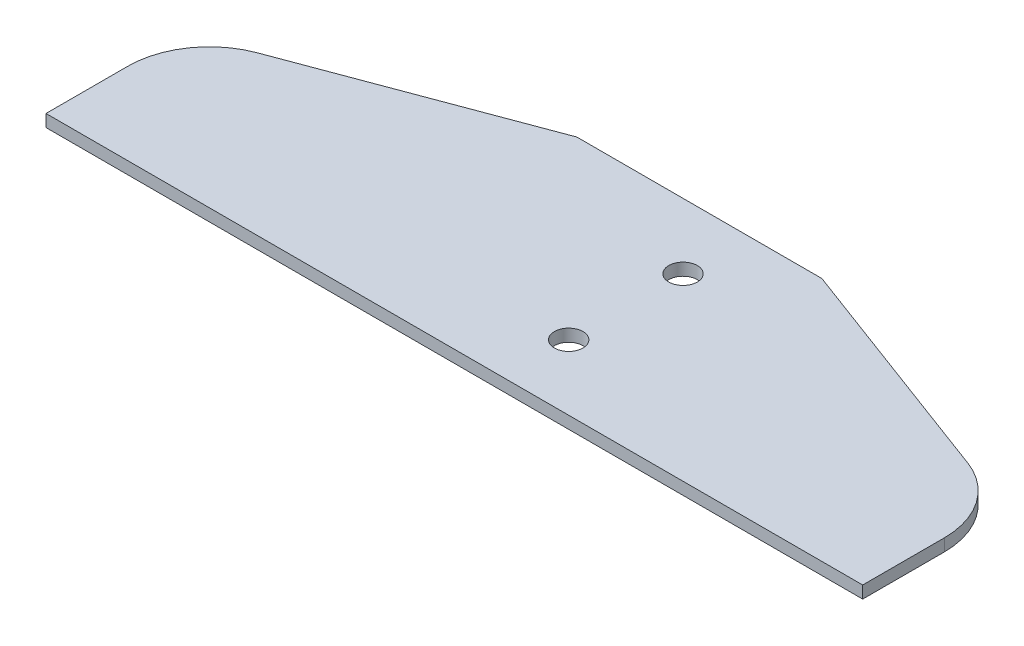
ISO-10303-21;
HEADER;
FILE_DESCRIPTION(('STEP AP214'),'2;1');
FILE_NAME('part.step','',(''),(''),'','','');
FILE_SCHEMA(('AUTOMOTIVE_DESIGN { 1 0 10303 214 1 1 1 1 }'));
ENDSEC;
DATA;
#1=APPLICATION_CONTEXT('core data for automotive mechanical design processes');
#2=APPLICATION_PROTOCOL_DEFINITION('international standard','automotive_design',2000,#1);
#3=PRODUCT_CONTEXT('',#1,'mechanical');
#4=PRODUCT('Part','Part','',(#3));
#5=PRODUCT_RELATED_PRODUCT_CATEGORY('part','',(#4));
#6=PRODUCT_DEFINITION_FORMATION('','',#4);
#7=PRODUCT_DEFINITION_CONTEXT('part definition',#1,'design');
#8=PRODUCT_DEFINITION('design','',#6,#7);
#9=PRODUCT_DEFINITION_SHAPE('','',#8);
#10=(LENGTH_UNIT() NAMED_UNIT(*) SI_UNIT(.MILLI.,.METRE.));
#11=(NAMED_UNIT(*) PLANE_ANGLE_UNIT() SI_UNIT($,.RADIAN.));
#12=(NAMED_UNIT(*) SI_UNIT($,.STERADIAN.) SOLID_ANGLE_UNIT());
#13=UNCERTAINTY_MEASURE_WITH_UNIT(LENGTH_MEASURE(1.E-05),#10,'distance_accuracy_value','');
#14=(GEOMETRIC_REPRESENTATION_CONTEXT(3) GLOBAL_UNCERTAINTY_ASSIGNED_CONTEXT((#13)) GLOBAL_UNIT_ASSIGNED_CONTEXT((#10,
#11,#12)) REPRESENTATION_CONTEXT('',''));
#15=CARTESIAN_POINT('',(0.,0.,0.));
#16=DIRECTION('',(0.,0.,1.));
#17=DIRECTION('',(1.,0.,0.));
#18=AXIS2_PLACEMENT_3D('',#15,#16,#17);
#19=CARTESIAN_POINT('',(39.9999999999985,1.5,-9.99999999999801));
#20=DIRECTION('',(0.,1.,0.));
#21=DIRECTION('',(0.,0.,1.));
#22=AXIS2_PLACEMENT_3D('',#19,#20,#21);
#23=PLANE('',#22);
#24=CARTESIAN_POINT('',(6.,1.5,-21.999999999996));
#25=DIRECTION('',(0.,1.,0.));
#26=DIRECTION('',(0.,0.,1.));
#27=AXIS2_PLACEMENT_3D('',#24,#25,#26);
#28=CIRCLE('',#27,1.75000000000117);
#29=CARTESIAN_POINT('',(6.,1.5,-20.2499999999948));
#30=VERTEX_POINT('',#29);
#31=EDGE_CURVE('E114',#30,#30,#28,.T.);
#32=ORIENTED_EDGE('',*,*,#31,.F.);
#33=EDGE_LOOP('',(#32));
#34=FACE_BOUND('',#33,.T.);
#35=DIRECTION('',(0.,0.,-1.));
#36=VECTOR('',#35,1.);
#37=CARTESIAN_POINT('',(49.9999999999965,1.5,0.));
#38=LINE('',#37,#36);
#39=CARTESIAN_POINT('',(49.9999999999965,1.5,0.));
#40=VERTEX_POINT('',#39);
#41=CARTESIAN_POINT('',(49.9999999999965,1.5,-9.99999999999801));
#42=VERTEX_POINT('',#41);
#43=EDGE_CURVE('E132',#40,#42,#38,.T.);
#44=ORIENTED_EDGE('',*,*,#43,.T.);
#45=CARTESIAN_POINT('',(39.9999999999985,1.5,-9.99999999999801));
#46=DIRECTION('',(0.,1.,0.));
#47=DIRECTION('',(0.,0.,1.));
#48=AXIS2_PLACEMENT_3D('',#45,#46,#47);
#49=CIRCLE('',#48,9.99999999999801);
#50=CARTESIAN_POINT('',(43.4953780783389,1.5,-19.3692225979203));
#51=VERTEX_POINT('',#50);
#52=EDGE_CURVE('E109',#42,#51,#49,.T.);
#53=ORIENTED_EDGE('',*,*,#52,.T.);
#54=DIRECTION('',(-0.936922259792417,0.,-0.349537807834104));
#55=VECTOR('',#54,1.);
#56=CARTESIAN_POINT('',(14.9999999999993,1.5,-30.0000000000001));
#57=LINE('',#56,#55);
#58=CARTESIAN_POINT('',(14.9999999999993,1.5,-30.0000000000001));
#59=VERTEX_POINT('',#58);
#60=EDGE_CURVE('E135',#51,#59,#57,.T.);
#61=ORIENTED_EDGE('',*,*,#60,.T.);
#62=DIRECTION('',(-1.,0.,0.));
#63=VECTOR('',#62,1.);
#64=CARTESIAN_POINT('',(-14.9999999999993,1.5,-30.0000000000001));
#65=LINE('',#64,#63);
#66=CARTESIAN_POINT('',(-14.9999999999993,1.5,-30.0000000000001));
#67=VERTEX_POINT('',#66);
#68=EDGE_CURVE('E137',#59,#67,#65,.T.);
#69=ORIENTED_EDGE('',*,*,#68,.T.);
#70=DIRECTION('',(-0.936922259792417,0.,0.349537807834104));
#71=VECTOR('',#70,1.);
#72=CARTESIAN_POINT('',(-14.9999999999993,1.5,-30.0000000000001));
#73=LINE('',#72,#71);
#74=CARTESIAN_POINT('',(-43.4953780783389,1.5,-19.3692225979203));
#75=VERTEX_POINT('',#74);
#76=EDGE_CURVE('E139',#67,#75,#73,.T.);
#77=ORIENTED_EDGE('',*,*,#76,.T.);
#78=CARTESIAN_POINT('',(-39.9999999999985,1.5,-9.99999999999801));
#79=DIRECTION('',(0.,1.,0.));
#80=DIRECTION('',(0.,0.,-1.));
#81=AXIS2_PLACEMENT_3D('',#78,#79,#80);
#82=CIRCLE('',#81,9.99999999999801);
#83=CARTESIAN_POINT('',(-49.9999999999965,1.5,-9.99999999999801));
#84=VERTEX_POINT('',#83);
#85=EDGE_CURVE('E141',#75,#84,#82,.T.);
#86=ORIENTED_EDGE('',*,*,#85,.T.);
#87=DIRECTION('',(0.,0.,1.));
#88=VECTOR('',#87,1.);
#89=CARTESIAN_POINT('',(-49.9999999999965,1.5,0.));
#90=LINE('',#89,#88);
#91=CARTESIAN_POINT('',(-49.9999999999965,1.5,0.));
#92=VERTEX_POINT('',#91);
#93=EDGE_CURVE('E50',#84,#92,#90,.T.);
#94=ORIENTED_EDGE('',*,*,#93,.T.);
#95=DIRECTION('',(1.,0.,0.));
#96=VECTOR('',#95,1.);
#97=CARTESIAN_POINT('',(-49.9999999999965,1.5,0.));
#98=LINE('',#97,#96);
#99=EDGE_CURVE('E45',#92,#40,#98,.T.);
#100=ORIENTED_EDGE('',*,*,#99,.T.);
#101=EDGE_LOOP('',(#44,#53,#61,#69,#77,#86,#94,#100));
#102=FACE_BOUND('',#101,.T.);
#103=CARTESIAN_POINT('',(6.,1.5,-7.99999999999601));
#104=DIRECTION('',(0.,1.,0.));
#105=DIRECTION('',(0.,0.,1.));
#106=AXIS2_PLACEMENT_3D('',#103,#104,#105);
#107=CIRCLE('',#106,1.75000000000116);
#108=CARTESIAN_POINT('',(6.,1.5,-6.24999999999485));
#109=VERTEX_POINT('',#108);
#110=EDGE_CURVE('E212',#109,#109,#107,.T.);
#111=ORIENTED_EDGE('',*,*,#110,.F.);
#112=EDGE_LOOP('',(#111));
#113=FACE_BOUND('',#112,.T.);
#114=ADVANCED_FACE('F30',(#34,#102,#113),#23,.T.);
#115=CARTESIAN_POINT('',(39.9999999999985,0.,-9.99999999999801));
#116=DIRECTION('',(0.,1.,0.));
#117=DIRECTION('',(0.,0.,1.));
#118=AXIS2_PLACEMENT_3D('',#115,#116,#117);
#119=PLANE('',#118);
#120=CARTESIAN_POINT('',(6.,0.,-21.999999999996));
#121=DIRECTION('',(0.,1.,0.));
#122=DIRECTION('',(0.,0.,1.));
#123=AXIS2_PLACEMENT_3D('',#120,#121,#122);
#124=CIRCLE('',#123,1.75000000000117);
#125=CARTESIAN_POINT('',(6.,0.,-20.2499999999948));
#126=VERTEX_POINT('',#125);
#127=EDGE_CURVE('E117',#126,#126,#124,.T.);
#128=ORIENTED_EDGE('',*,*,#127,.T.);
#129=EDGE_LOOP('',(#128));
#130=FACE_BOUND('',#129,.T.);
#131=DIRECTION('',(0.,0.,-1.));
#132=VECTOR('',#131,1.);
#133=CARTESIAN_POINT('',(49.9999999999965,0.,0.));
#134=LINE('',#133,#132);
#135=CARTESIAN_POINT('',(49.9999999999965,0.,0.));
#136=VERTEX_POINT('',#135);
#137=CARTESIAN_POINT('',(49.9999999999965,0.,-9.99999999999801));
#138=VERTEX_POINT('',#137);
#139=EDGE_CURVE('E100',#136,#138,#134,.T.);
#140=ORIENTED_EDGE('',*,*,#139,.F.);
#141=DIRECTION('',(1.,0.,0.));
#142=VECTOR('',#141,1.);
#143=CARTESIAN_POINT('',(-49.9999999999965,0.,0.));
#144=LINE('',#143,#142);
#145=CARTESIAN_POINT('',(-49.9999999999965,0.,0.));
#146=VERTEX_POINT('',#145);
#147=EDGE_CURVE('E130',#146,#136,#144,.T.);
#148=ORIENTED_EDGE('',*,*,#147,.F.);
#149=DIRECTION('',(0.,0.,1.));
#150=VECTOR('',#149,1.);
#151=CARTESIAN_POINT('',(-49.9999999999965,0.,0.));
#152=LINE('',#151,#150);
#153=CARTESIAN_POINT('',(-49.9999999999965,0.,-9.99999999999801));
#154=VERTEX_POINT('',#153);
#155=EDGE_CURVE('E128',#154,#146,#152,.T.);
#156=ORIENTED_EDGE('',*,*,#155,.F.);
#157=CARTESIAN_POINT('',(-39.9999999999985,0.,-9.99999999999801));
#158=DIRECTION('',(0.,1.,0.));
#159=DIRECTION('',(0.,0.,-1.));
#160=AXIS2_PLACEMENT_3D('',#157,#158,#159);
#161=CIRCLE('',#160,9.99999999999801);
#162=CARTESIAN_POINT('',(-43.4953780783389,0.,-19.3692225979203));
#163=VERTEX_POINT('',#162);
#164=EDGE_CURVE('E126',#163,#154,#161,.T.);
#165=ORIENTED_EDGE('',*,*,#164,.F.);
#166=DIRECTION('',(-0.936922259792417,0.,0.349537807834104));
#167=VECTOR('',#166,1.);
#168=CARTESIAN_POINT('',(-14.9999999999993,0.,-30.0000000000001));
#169=LINE('',#168,#167);
#170=CARTESIAN_POINT('',(-14.9999999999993,0.,-30.0000000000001));
#171=VERTEX_POINT('',#170);
#172=EDGE_CURVE('E124',#171,#163,#169,.T.);
#173=ORIENTED_EDGE('',*,*,#172,.F.);
#174=DIRECTION('',(-1.,0.,0.));
#175=VECTOR('',#174,1.);
#176=CARTESIAN_POINT('',(-14.9999999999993,0.,-30.0000000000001));
#177=LINE('',#176,#175);
#178=CARTESIAN_POINT('',(14.9999999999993,0.,-30.0000000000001));
#179=VERTEX_POINT('',#178);
#180=EDGE_CURVE('E122',#179,#171,#177,.T.);
#181=ORIENTED_EDGE('',*,*,#180,.F.);
#182=DIRECTION('',(-0.936922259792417,0.,-0.349537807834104));
#183=VECTOR('',#182,1.);
#184=CARTESIAN_POINT('',(14.9999999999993,0.,-30.0000000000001));
#185=LINE('',#184,#183);
#186=CARTESIAN_POINT('',(43.4953780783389,0.,-19.3692225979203));
#187=VERTEX_POINT('',#186);
#188=EDGE_CURVE('E102',#187,#179,#185,.T.);
#189=ORIENTED_EDGE('',*,*,#188,.F.);
#190=CARTESIAN_POINT('',(39.9999999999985,0.,-9.99999999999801));
#191=DIRECTION('',(0.,1.,0.));
#192=DIRECTION('',(0.,0.,1.));
#193=AXIS2_PLACEMENT_3D('',#190,#191,#192);
#194=CIRCLE('',#193,9.99999999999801);
#195=EDGE_CURVE('E95',#138,#187,#194,.T.);
#196=ORIENTED_EDGE('',*,*,#195,.F.);
#197=EDGE_LOOP('',(#140,#148,#156,#165,#173,#181,#189,#196));
#198=FACE_BOUND('',#197,.T.);
#199=CARTESIAN_POINT('',(6.,0.,-7.99999999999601));
#200=DIRECTION('',(0.,1.,0.));
#201=DIRECTION('',(0.,0.,1.));
#202=AXIS2_PLACEMENT_3D('',#199,#200,#201);
#203=CIRCLE('',#202,1.75000000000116);
#204=CARTESIAN_POINT('',(6.,0.,-6.24999999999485));
#205=VERTEX_POINT('',#204);
#206=EDGE_CURVE('E215',#205,#205,#203,.T.);
#207=ORIENTED_EDGE('',*,*,#206,.T.);
#208=EDGE_LOOP('',(#207));
#209=FACE_BOUND('',#208,.T.);
#210=ADVANCED_FACE('F96',(#130,#198,#209),#119,.F.);
#211=CARTESIAN_POINT('',(49.9999999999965,1.5,0.));
#212=DIRECTION('',(-1.,0.,0.));
#213=DIRECTION('',(0.,0.,1.));
#214=AXIS2_PLACEMENT_3D('',#211,#212,#213);
#215=PLANE('',#214);
#216=ORIENTED_EDGE('',*,*,#139,.T.);
#217=DIRECTION('',(0.,-1.,0.));
#218=VECTOR('',#217,1.);
#219=CARTESIAN_POINT('',(49.9999999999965,1.5,-9.99999999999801));
#220=LINE('',#219,#218);
#221=EDGE_CURVE('E11',#42,#138,#220,.T.);
#222=ORIENTED_EDGE('',*,*,#221,.F.);
#223=ORIENTED_EDGE('',*,*,#43,.F.);
#224=DIRECTION('',(0.,-1.,0.));
#225=VECTOR('',#224,1.);
#226=CARTESIAN_POINT('',(49.9999999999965,1.5,0.));
#227=LINE('',#226,#225);
#228=EDGE_CURVE('E113',#40,#136,#227,.T.);
#229=ORIENTED_EDGE('',*,*,#228,.T.);
#230=EDGE_LOOP('',(#216,#222,#223,#229));
#231=FACE_BOUND('',#230,.T.);
#232=ADVANCED_FACE('F32',(#231),#215,.F.);
#233=CARTESIAN_POINT('',(39.9999999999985,1.5,-9.99999999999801));
#234=DIRECTION('',(0.,-1.,0.));
#235=DIRECTION('',(0.,0.,-1.));
#236=AXIS2_PLACEMENT_3D('',#233,#234,#235);
#237=CYLINDRICAL_SURFACE('',#236,9.99999999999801);
#238=ORIENTED_EDGE('',*,*,#195,.T.);
#239=DIRECTION('',(0.,-1.,0.));
#240=VECTOR('',#239,1.);
#241=CARTESIAN_POINT('',(43.4953780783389,1.5,-19.3692225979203));
#242=LINE('',#241,#240);
#243=EDGE_CURVE('E38',#51,#187,#242,.T.);
#244=ORIENTED_EDGE('',*,*,#243,.F.);
#245=ORIENTED_EDGE('',*,*,#52,.F.);
#246=ORIENTED_EDGE('',*,*,#221,.T.);
#247=EDGE_LOOP('',(#238,#244,#245,#246));
#248=FACE_BOUND('',#247,.T.);
#249=ADVANCED_FACE('F108',(#248),#237,.T.);
#250=CARTESIAN_POINT('',(14.9999999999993,1.5,-30.0000000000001));
#251=DIRECTION('',(-0.349537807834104,0.,0.936922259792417));
#252=DIRECTION('',(0.936922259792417,0.,0.349537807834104));
#253=AXIS2_PLACEMENT_3D('',#250,#251,#252);
#254=PLANE('',#253);
#255=ORIENTED_EDGE('',*,*,#188,.T.);
#256=DIRECTION('',(0.,-1.,0.));
#257=VECTOR('',#256,1.);
#258=CARTESIAN_POINT('',(14.9999999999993,1.5,-30.0000000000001));
#259=LINE('',#258,#257);
#260=EDGE_CURVE('E158',#59,#179,#259,.T.);
#261=ORIENTED_EDGE('',*,*,#260,.F.);
#262=ORIENTED_EDGE('',*,*,#60,.F.);
#263=ORIENTED_EDGE('',*,*,#243,.T.);
#264=EDGE_LOOP('',(#255,#261,#262,#263));
#265=FACE_BOUND('',#264,.T.);
#266=ADVANCED_FACE('F162',(#265),#254,.F.);
#267=CARTESIAN_POINT('',(-14.9999999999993,1.5,-30.0000000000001));
#268=DIRECTION('',(0.,0.,1.));
#269=DIRECTION('',(1.,0.,0.));
#270=AXIS2_PLACEMENT_3D('',#267,#268,#269);
#271=PLANE('',#270);
#272=ORIENTED_EDGE('',*,*,#180,.T.);
#273=DIRECTION('',(0.,-1.,0.));
#274=VECTOR('',#273,1.);
#275=CARTESIAN_POINT('',(-14.9999999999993,1.5,-30.0000000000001));
#276=LINE('',#275,#274);
#277=EDGE_CURVE('E155',#67,#171,#276,.T.);
#278=ORIENTED_EDGE('',*,*,#277,.F.);
#279=ORIENTED_EDGE('',*,*,#68,.F.);
#280=ORIENTED_EDGE('',*,*,#260,.T.);
#281=EDGE_LOOP('',(#272,#278,#279,#280));
#282=FACE_BOUND('',#281,.T.);
#283=ADVANCED_FACE('F170',(#282),#271,.F.);
#284=CARTESIAN_POINT('',(-14.9999999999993,1.5,-30.0000000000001));
#285=DIRECTION('',(0.349537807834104,0.,0.936922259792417));
#286=DIRECTION('',(0.936922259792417,0.,-0.349537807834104));
#287=AXIS2_PLACEMENT_3D('',#284,#285,#286);
#288=PLANE('',#287);
#289=ORIENTED_EDGE('',*,*,#172,.T.);
#290=DIRECTION('',(0.,-1.,0.));
#291=VECTOR('',#290,1.);
#292=CARTESIAN_POINT('',(-43.4953780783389,1.5,-19.3692225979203));
#293=LINE('',#292,#291);
#294=EDGE_CURVE('E152',#75,#163,#293,.T.);
#295=ORIENTED_EDGE('',*,*,#294,.F.);
#296=ORIENTED_EDGE('',*,*,#76,.F.);
#297=ORIENTED_EDGE('',*,*,#277,.T.);
#298=EDGE_LOOP('',(#289,#295,#296,#297));
#299=FACE_BOUND('',#298,.T.);
#300=ADVANCED_FACE('F173',(#299),#288,.F.);
#301=CARTESIAN_POINT('',(-39.9999999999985,1.5,-9.99999999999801));
#302=DIRECTION('',(0.,-1.,0.));
#303=DIRECTION('',(0.,0.,-1.));
#304=AXIS2_PLACEMENT_3D('',#301,#302,#303);
#305=CYLINDRICAL_SURFACE('',#304,9.99999999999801);
#306=ORIENTED_EDGE('',*,*,#164,.T.);
#307=DIRECTION('',(0.,-1.,0.));
#308=VECTOR('',#307,1.);
#309=CARTESIAN_POINT('',(-49.9999999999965,1.5,-9.99999999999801));
#310=LINE('',#309,#308);
#311=EDGE_CURVE('E149',#84,#154,#310,.T.);
#312=ORIENTED_EDGE('',*,*,#311,.F.);
#313=ORIENTED_EDGE('',*,*,#85,.F.);
#314=ORIENTED_EDGE('',*,*,#294,.T.);
#315=EDGE_LOOP('',(#306,#312,#313,#314));
#316=FACE_BOUND('',#315,.T.);
#317=ADVANCED_FACE('F178',(#316),#305,.T.);
#318=CARTESIAN_POINT('',(-49.9999999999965,1.5,0.));
#319=DIRECTION('',(1.,0.,0.));
#320=DIRECTION('',(0.,0.,-1.));
#321=AXIS2_PLACEMENT_3D('',#318,#319,#320);
#322=PLANE('',#321);
#323=ORIENTED_EDGE('',*,*,#155,.T.);
#324=DIRECTION('',(0.,-1.,0.));
#325=VECTOR('',#324,1.);
#326=CARTESIAN_POINT('',(-49.9999999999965,1.5,0.));
#327=LINE('',#326,#325);
#328=EDGE_CURVE('E146',#92,#146,#327,.T.);
#329=ORIENTED_EDGE('',*,*,#328,.F.);
#330=ORIENTED_EDGE('',*,*,#93,.F.);
#331=ORIENTED_EDGE('',*,*,#311,.T.);
#332=EDGE_LOOP('',(#323,#329,#330,#331));
#333=FACE_BOUND('',#332,.T.);
#334=ADVANCED_FACE('F181',(#333),#322,.F.);
#335=CARTESIAN_POINT('',(-49.9999999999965,1.5,0.));
#336=DIRECTION('',(0.,0.,-1.));
#337=DIRECTION('',(-1.,0.,0.));
#338=AXIS2_PLACEMENT_3D('',#335,#336,#337);
#339=PLANE('',#338);
#340=ORIENTED_EDGE('',*,*,#147,.T.);
#341=ORIENTED_EDGE('',*,*,#228,.F.);
#342=ORIENTED_EDGE('',*,*,#99,.F.);
#343=ORIENTED_EDGE('',*,*,#328,.T.);
#344=EDGE_LOOP('',(#340,#341,#342,#343));
#345=FACE_BOUND('',#344,.T.);
#346=ADVANCED_FACE('F183',(#345),#339,.F.);
#347=CARTESIAN_POINT('',(6.,1.5,-21.999999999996));
#348=DIRECTION('',(0.,-1.,0.));
#349=DIRECTION('',(0.,0.,-1.));
#350=AXIS2_PLACEMENT_3D('',#347,#348,#349);
#351=CYLINDRICAL_SURFACE('',#350,1.75000000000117);
#352=ORIENTED_EDGE('',*,*,#31,.T.);
#353=EDGE_LOOP('',(#352));
#354=FACE_BOUND('',#353,.T.);
#355=ORIENTED_EDGE('',*,*,#127,.F.);
#356=EDGE_LOOP('',(#355));
#357=FACE_BOUND('',#356,.T.);
#358=ADVANCED_FACE('F185',(#354,#357),#351,.F.);
#359=CARTESIAN_POINT('',(6.,1.5,-7.99999999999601));
#360=DIRECTION('',(0.,-1.,0.));
#361=DIRECTION('',(0.,0.,-1.));
#362=AXIS2_PLACEMENT_3D('',#359,#360,#361);
#363=CYLINDRICAL_SURFACE('',#362,1.75000000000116);
#364=ORIENTED_EDGE('',*,*,#110,.T.);
#365=EDGE_LOOP('',(#364));
#366=FACE_BOUND('',#365,.T.);
#367=ORIENTED_EDGE('',*,*,#206,.F.);
#368=EDGE_LOOP('',(#367));
#369=FACE_BOUND('',#368,.T.);
#370=ADVANCED_FACE('F191',(#366,#369),#363,.F.);
#371=CLOSED_SHELL('',(#114,#210,#232,#249,#266,#283,#300,#317,#334,#346,#358,#370));
#372=MANIFOLD_SOLID_BREP('B2',#371);
#373=ADVANCED_BREP_SHAPE_REPRESENTATION('',(#18,#372),#14);
#374=SHAPE_DEFINITION_REPRESENTATION(#9,#373);
ENDSEC;
END-ISO-10303-21;
